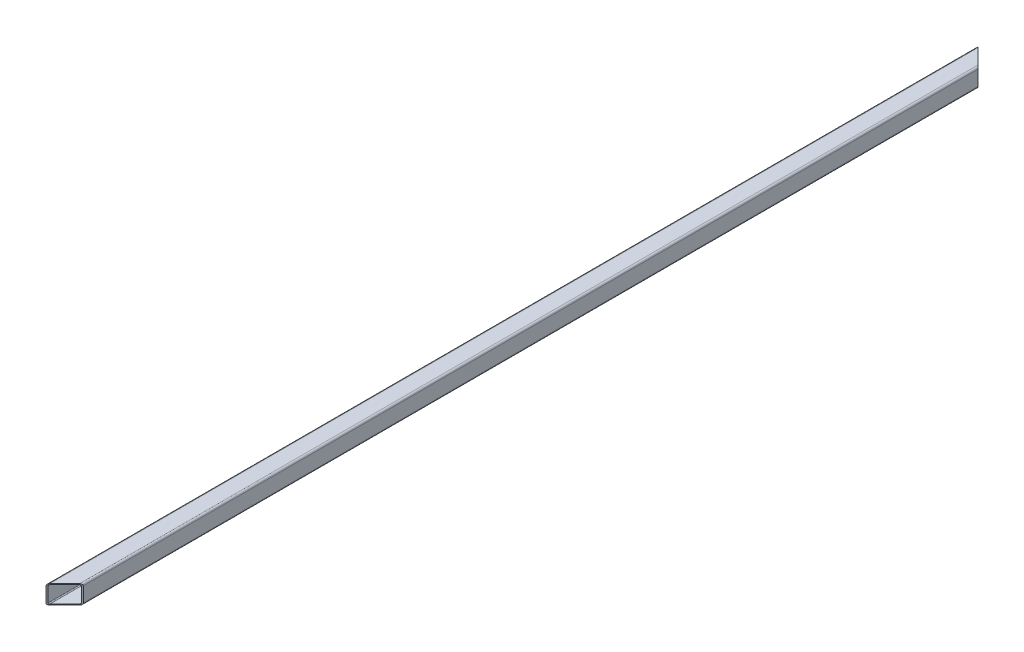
from build123d import *

# Parameters (mm, degrees)
AUFSATZ_LIN_GK_START         = -1500
AUFSATZ_LIN_GK_DEPTH         = 3000
SCHNITT_LIN_GEHRUNG_HI_DEPTH = 1503.398083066


with BuildPart() as part:
    # Profil → Aufsatz-Lin_GK (new body)
    with BuildSketch(Plane.XY.offset(AUFSATZ_LIN_GK_START)):
        with BuildLine():
            Line((6, -60), (54, -60))
            ThreePointArc((54, -60), (58.242640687, -58.242640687), (60, -54))
            Line((60, -54), (60, -6))
            ThreePointArc((60, -6), (58.242640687, -1.757359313), (54, 0))
            Line((54, 0), (6, 0))
            ThreePointArc((6, 0), (1.757359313, -1.757359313), (0, -6))
            Line((0, -6), (0, -54))
            ThreePointArc((0, -54), (1.757359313, -58.242640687), (6, -60))
        make_face()
        with BuildLine():
            Line((3, -54), (3, -6))
            ThreePointArc((3, -6), (3.878679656, -3.878679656), (6, -3))
            Line((6, -3), (54, -3))
            ThreePointArc((54, -3), (56.121320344, -3.878679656), (57, -6))
            Line((57, -6), (57, -54))
            ThreePointArc((57, -54), (56.121320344, -56.121320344), (54, -57))
            Line((54, -57), (6, -57))
            ThreePointArc((6, -57), (3.878679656, -56.121320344), (3, -54))
        make_face(mode=Mode.SUBTRACT)
    extrude(amount=AUFSATZ_LIN_GK_DEPTH)

    # Gehrung hi → Schnitt-Lin_Gehrung hi (cut, through all)
    with BuildSketch(Plane(origin=(0, 0, 0), x_dir=(1, 0, 0), z_dir=(0, 1, 0))):
        Polygon((-4250.560198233, 5750.560198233), (0, 1500), (60, 1440), (4310.560198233, -2810.560198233), (12811.680594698, 5690.560198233), (4250.560198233, 14251.680594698), align=None)
    schnitt_lin_gehrung_hi = extrude(amount=-SCHNITT_LIN_GEHRUNG_HI_DEPTH, mode=Mode.SUBTRACT)

    # Spiegeln_Gehrung vo: Schnitt-Lin_Gehrung hi across plane
    add(schnitt_lin_gehrung_hi.mirror(Plane.XY), mode=Mode.SUBTRACT)


solid = part.part
